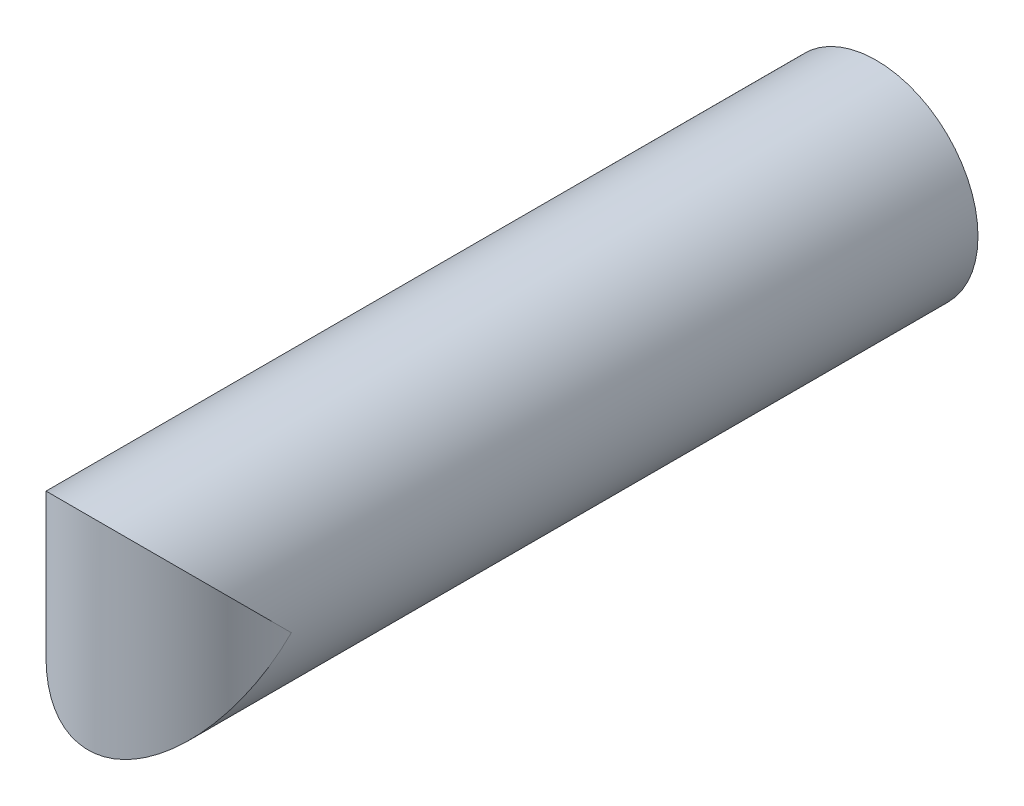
ISO-10303-21;
HEADER;
FILE_DESCRIPTION(('STEP AP214'),'2;1');
FILE_NAME('part.step','',(''),(''),'','','');
FILE_SCHEMA(('AUTOMOTIVE_DESIGN { 1 0 10303 214 1 1 1 1 }'));
ENDSEC;
DATA;
#1=APPLICATION_CONTEXT('core data for automotive mechanical design processes');
#2=APPLICATION_PROTOCOL_DEFINITION('international standard','automotive_design',2000,#1);
#3=PRODUCT_CONTEXT('',#1,'mechanical');
#4=PRODUCT('Part','Part','',(#3));
#5=PRODUCT_RELATED_PRODUCT_CATEGORY('part','',(#4));
#6=PRODUCT_DEFINITION_FORMATION('','',#4);
#7=PRODUCT_DEFINITION_CONTEXT('part definition',#1,'design');
#8=PRODUCT_DEFINITION('design','',#6,#7);
#9=PRODUCT_DEFINITION_SHAPE('','',#8);
#10=(LENGTH_UNIT() NAMED_UNIT(*) SI_UNIT(.MILLI.,.METRE.));
#11=(NAMED_UNIT(*) PLANE_ANGLE_UNIT() SI_UNIT($,.RADIAN.));
#12=(NAMED_UNIT(*) SI_UNIT($,.STERADIAN.) SOLID_ANGLE_UNIT());
#13=UNCERTAINTY_MEASURE_WITH_UNIT(LENGTH_MEASURE(1.E-05),#10,'distance_accuracy_value','');
#14=(GEOMETRIC_REPRESENTATION_CONTEXT(3) GLOBAL_UNCERTAINTY_ASSIGNED_CONTEXT((#13)) GLOBAL_UNIT_ASSIGNED_CONTEXT((#10,
#11,#12)) REPRESENTATION_CONTEXT('',''));
#15=CARTESIAN_POINT('',(0.,0.,0.));
#16=DIRECTION('',(0.,0.,1.));
#17=DIRECTION('',(1.,0.,0.));
#18=AXIS2_PLACEMENT_3D('',#15,#16,#17);
#19=CARTESIAN_POINT('',(0.,0.,15.9));
#20=DIRECTION('',(0.,0.,-1.));
#21=DIRECTION('',(-1.,0.,0.));
#22=AXIS2_PLACEMENT_3D('',#19,#20,#21);
#23=CYLINDRICAL_SURFACE('',#22,2.05);
#24=CARTESIAN_POINT('',(0.,1.27675647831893E-12,13.85));
#25=DIRECTION('',(0.,-0.707106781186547,-0.707106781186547));
#26=DIRECTION('',(0.,0.707106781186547,-0.707106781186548));
#27=AXIS2_PLACEMENT_3D('',#24,#25,#26);
#28=ELLIPSE('',#27,2.89913780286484,2.05);
#29=CARTESIAN_POINT('',(2.05000000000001,7.7715611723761E-13,13.85));
#30=VERTEX_POINT('',#29);
#31=CARTESIAN_POINT('',(-2.05000000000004,-4.9960036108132E-13,13.85));
#32=VERTEX_POINT('',#31);
#33=EDGE_CURVE('E39',#30,#32,#28,.T.);
#34=ORIENTED_EDGE('',*,*,#33,.T.);
#35=CARTESIAN_POINT('',(0.,1.27675647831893E-12,13.85));
#36=DIRECTION('',(0.,0.707106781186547,-0.707106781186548));
#37=DIRECTION('',(0.,-0.707106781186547,-0.707106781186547));
#38=AXIS2_PLACEMENT_3D('',#35,#36,#37);
#39=ELLIPSE('',#38,2.89913780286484,2.05);
#40=EDGE_CURVE('E45',#32,#30,#39,.T.);
#41=ORIENTED_EDGE('',*,*,#40,.T.);
#42=EDGE_LOOP('',(#34,#41));
#43=FACE_BOUND('',#42,.T.);
#44=CARTESIAN_POINT('',(0.,0.,0.));
#45=DIRECTION('',(0.,0.,1.));
#46=DIRECTION('',(1.,0.,0.));
#47=AXIS2_PLACEMENT_3D('',#44,#45,#46);
#48=CIRCLE('',#47,2.05);
#49=CARTESIAN_POINT('',(2.05,0.,0.));
#50=VERTEX_POINT('',#49);
#51=EDGE_CURVE('E11',#50,#50,#48,.T.);
#52=ORIENTED_EDGE('',*,*,#51,.T.);
#53=EDGE_LOOP('',(#52));
#54=FACE_BOUND('',#53,.T.);
#55=ADVANCED_FACE('F32',(#43,#54),#23,.T.);
#56=CARTESIAN_POINT('',(0.,0.,0.));
#57=DIRECTION('',(0.,0.,1.));
#58=DIRECTION('',(1.,0.,0.));
#59=AXIS2_PLACEMENT_3D('',#56,#57,#58);
#60=PLANE('',#59);
#61=ORIENTED_EDGE('',*,*,#51,.F.);
#62=EDGE_LOOP('',(#61));
#63=FACE_BOUND('',#62,.T.);
#64=ADVANCED_FACE('F52',(#63),#60,.F.);
#65=CARTESIAN_POINT('',(0.,-19.9999999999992,13.85));
#66=DIRECTION('',(0.,1.,0.));
#67=DIRECTION('',(0.,0.,1.));
#68=AXIS2_PLACEMENT_3D('',#65,#66,#67);
#69=CYLINDRICAL_SURFACE('',#68,2.05);
#70=ORIENTED_EDGE('',*,*,#40,.F.);
#71=ORIENTED_EDGE('',*,*,#33,.F.);
#72=EDGE_LOOP('',(#70,#71));
#73=FACE_BOUND('',#72,.T.);
#74=ADVANCED_FACE('F47',(#73),#69,.T.);
#75=CLOSED_SHELL('',(#55,#64,#74));
#76=MANIFOLD_SOLID_BREP('B2',#75);
#77=ADVANCED_BREP_SHAPE_REPRESENTATION('',(#18,#76),#14);
#78=SHAPE_DEFINITION_REPRESENTATION(#9,#77);
ENDSEC;
END-ISO-10303-21;
